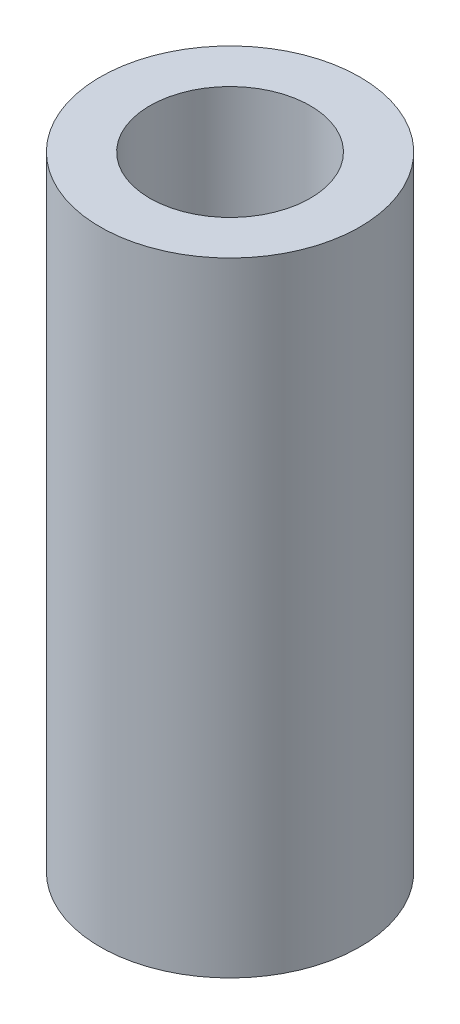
ISO-10303-21;
HEADER;
FILE_DESCRIPTION(('STEP AP214'),'2;1');
FILE_NAME('part.step','',(''),(''),'','','');
FILE_SCHEMA(('AUTOMOTIVE_DESIGN { 1 0 10303 214 1 1 1 1 }'));
ENDSEC;
DATA;
#1=APPLICATION_CONTEXT('core data for automotive mechanical design processes');
#2=APPLICATION_PROTOCOL_DEFINITION('international standard','automotive_design',2000,#1);
#3=PRODUCT_CONTEXT('',#1,'mechanical');
#4=PRODUCT('Part','Part','',(#3));
#5=PRODUCT_RELATED_PRODUCT_CATEGORY('part','',(#4));
#6=PRODUCT_DEFINITION_FORMATION('','',#4);
#7=PRODUCT_DEFINITION_CONTEXT('part definition',#1,'design');
#8=PRODUCT_DEFINITION('design','',#6,#7);
#9=PRODUCT_DEFINITION_SHAPE('','',#8);
#10=(LENGTH_UNIT() NAMED_UNIT(*) SI_UNIT(.MILLI.,.METRE.));
#11=(NAMED_UNIT(*) PLANE_ANGLE_UNIT() SI_UNIT($,.RADIAN.));
#12=(NAMED_UNIT(*) SI_UNIT($,.STERADIAN.) SOLID_ANGLE_UNIT());
#13=UNCERTAINTY_MEASURE_WITH_UNIT(LENGTH_MEASURE(1.E-05),#10,'distance_accuracy_value','');
#14=(GEOMETRIC_REPRESENTATION_CONTEXT(3) GLOBAL_UNCERTAINTY_ASSIGNED_CONTEXT((#13)) GLOBAL_UNIT_ASSIGNED_CONTEXT((#10,
#11,#12)) REPRESENTATION_CONTEXT('',''));
#15=CARTESIAN_POINT('',(0.,0.,0.));
#16=DIRECTION('',(0.,0.,1.));
#17=DIRECTION('',(1.,0.,0.));
#18=AXIS2_PLACEMENT_3D('',#15,#16,#17);
#19=CARTESIAN_POINT('',(0.,38.1,0.));
#20=DIRECTION('',(0.,-1.,0.));
#21=DIRECTION('',(0.,0.,-1.));
#22=AXIS2_PLACEMENT_3D('',#19,#20,#21);
#23=CYLINDRICAL_SURFACE('',#22,7.9375);
#24=CARTESIAN_POINT('',(0.,38.1,0.));
#25=DIRECTION('',(0.,1.,0.));
#26=DIRECTION('',(0.,0.,1.));
#27=AXIS2_PLACEMENT_3D('',#24,#25,#26);
#28=CIRCLE('',#27,7.9375);
#29=CARTESIAN_POINT('',(0.,38.1,-7.9375));
#30=VERTEX_POINT('',#29);
#31=EDGE_CURVE('E10',#30,#30,#28,.T.);
#32=CARTESIAN_POINT('',(0.,0.,0.));
#33=DIRECTION('',(0.,1.,0.));
#34=DIRECTION('',(0.,0.,1.));
#35=AXIS2_PLACEMENT_3D('',#32,#33,#34);
#36=CIRCLE('',#35,7.9375);
#37=CARTESIAN_POINT('',(0.,0.,-7.9375));
#38=VERTEX_POINT('',#37);
#39=EDGE_CURVE('E40',#38,#38,#36,.T.);
#40=CARTESIAN_POINT('',(0.,38.1,-7.9375));
#41=CARTESIAN_POINT('',(0.,37.703125,-7.9375));
#42=CARTESIAN_POINT('',(0.,37.30625,-7.9375));
#43=CARTESIAN_POINT('',(0.,36.5125,-7.9375));
#44=CARTESIAN_POINT('',(0.,36.115625,-7.9375));
#45=CARTESIAN_POINT('',(0.,35.321875,-7.9375));
#46=CARTESIAN_POINT('',(0.,34.925,-7.9375));
#47=CARTESIAN_POINT('',(0.,34.13125,-7.9375));
#48=CARTESIAN_POINT('',(0.,33.734375,-7.9375));
#49=CARTESIAN_POINT('',(0.,32.940625,-7.9375));
#50=CARTESIAN_POINT('',(0.,32.54375,-7.9375));
#51=CARTESIAN_POINT('',(0.,31.75,-7.9375));
#52=CARTESIAN_POINT('',(0.,31.353125,-7.9375));
#53=CARTESIAN_POINT('',(0.,30.559375,-7.9375));
#54=CARTESIAN_POINT('',(0.,30.1625,-7.9375));
#55=CARTESIAN_POINT('',(0.,29.36875,-7.9375));
#56=CARTESIAN_POINT('',(0.,28.971875,-7.9375));
#57=CARTESIAN_POINT('',(0.,28.178125,-7.9375));
#58=CARTESIAN_POINT('',(0.,27.78125,-7.9375));
#59=CARTESIAN_POINT('',(0.,26.9875,-7.9375));
#60=CARTESIAN_POINT('',(0.,26.590625,-7.9375));
#61=CARTESIAN_POINT('',(0.,25.796875,-7.9375));
#62=CARTESIAN_POINT('',(0.,25.4,-7.9375));
#63=CARTESIAN_POINT('',(0.,24.60625,-7.9375));
#64=CARTESIAN_POINT('',(0.,24.209375,-7.9375));
#65=CARTESIAN_POINT('',(0.,23.415625,-7.9375));
#66=CARTESIAN_POINT('',(0.,23.01875,-7.9375));
#67=CARTESIAN_POINT('',(0.,22.225,-7.9375));
#68=CARTESIAN_POINT('',(0.,21.828125,-7.9375));
#69=CARTESIAN_POINT('',(0.,21.034375,-7.9375));
#70=CARTESIAN_POINT('',(0.,20.6375,-7.9375));
#71=CARTESIAN_POINT('',(0.,19.84375,-7.9375));
#72=CARTESIAN_POINT('',(0.,19.446875,-7.9375));
#73=CARTESIAN_POINT('',(0.,18.653125,-7.9375));
#74=CARTESIAN_POINT('',(0.,18.25625,-7.9375));
#75=CARTESIAN_POINT('',(0.,17.4625,-7.9375));
#76=CARTESIAN_POINT('',(0.,17.065625,-7.9375));
#77=CARTESIAN_POINT('',(0.,16.271875,-7.9375));
#78=CARTESIAN_POINT('',(0.,15.875,-7.9375));
#79=CARTESIAN_POINT('',(0.,15.08125,-7.9375));
#80=CARTESIAN_POINT('',(0.,14.684375,-7.9375));
#81=CARTESIAN_POINT('',(0.,13.890625,-7.9375));
#82=CARTESIAN_POINT('',(0.,13.49375,-7.9375));
#83=CARTESIAN_POINT('',(0.,12.7,-7.9375));
#84=CARTESIAN_POINT('',(0.,12.303125,-7.9375));
#85=CARTESIAN_POINT('',(0.,11.509375,-7.9375));
#86=CARTESIAN_POINT('',(0.,11.1125,-7.9375));
#87=CARTESIAN_POINT('',(0.,10.31875,-7.9375));
#88=CARTESIAN_POINT('',(0.,9.92187499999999,-7.9375));
#89=CARTESIAN_POINT('',(0.,9.128125,-7.9375));
#90=CARTESIAN_POINT('',(0.,8.73124999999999,-7.9375));
#91=CARTESIAN_POINT('',(0.,7.93749999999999,-7.9375));
#92=CARTESIAN_POINT('',(0.,7.54062499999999,-7.9375));
#93=CARTESIAN_POINT('',(0.,6.746875,-7.9375));
#94=CARTESIAN_POINT('',(0.,6.35,-7.9375));
#95=CARTESIAN_POINT('',(0.,5.55625,-7.9375));
#96=CARTESIAN_POINT('',(0.,5.159375,-7.9375));
#97=CARTESIAN_POINT('',(0.,4.365625,-7.9375));
#98=CARTESIAN_POINT('',(0.,3.96875,-7.9375));
#99=CARTESIAN_POINT('',(0.,3.175,-7.9375));
#100=CARTESIAN_POINT('',(0.,2.778125,-7.9375));
#101=CARTESIAN_POINT('',(0.,1.984375,-7.9375));
#102=CARTESIAN_POINT('',(0.,1.5875,-7.9375));
#103=CARTESIAN_POINT('',(0.,0.79375,-7.9375));
#104=CARTESIAN_POINT('',(0.,0.396875,-7.9375));
#105=CARTESIAN_POINT('',(0.,0.,-7.9375));
#106=B_SPLINE_CURVE_WITH_KNOTS('',3,(#40,#41,#42,#43,#44,#45,#46,#47,#48,#49,#50,#51,#52,#53,
#54,#55,#56,#57,#58,#59,#60,#61,#62,#63,#64,#65,#66,#67,#68,#69,#70,#71,#72,#73,#74,#75,#76,#77,
#78,#79,#80,#81,#82,#83,#84,#85,#86,#87,#88,#89,#90,#91,#92,#93,#94,#95,#96,#97,#98,#99,#100,
#101,#102,#103,#104,#105),.UNSPECIFIED.,.F.,.F.,(4,2,2,2,2,2,2,2,2,2,2,2,2,2,2,2,2,2,2,2,2,2,2,
2,2,2,2,2,2,2,2,2,4),(0.,1.190625,2.38125,3.571875,4.7625,5.953125,7.14375,8.334375,
9.52500000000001,10.715625,11.90625,13.096875,14.2875,15.478125,16.66875,17.859375,19.05,
20.240625,21.43125,22.621875,23.8125,25.003125,26.19375,27.384375,28.575,29.765625,30.95625,
32.146875,33.3375,34.528125,35.71875,36.909375,38.1),.UNSPECIFIED.);
#107=EDGE_CURVE('BSEAM34',#30,#38,#106,.T.);
#108=ORIENTED_EDGE('',*,*,#31,.F.);
#109=ORIENTED_EDGE('',*,*,#39,.T.);
#110=ORIENTED_EDGE('',*,*,#107,.T.);
#111=ORIENTED_EDGE('',*,*,#107,.F.);
#112=EDGE_LOOP('',(#108,#110,#109,#111));
#113=FACE_BOUND('',#112,.T.);
#114=ADVANCED_FACE('F34',(#113),#23,.T.);
#115=CARTESIAN_POINT('',(0.,38.1,0.));
#116=DIRECTION('',(0.,1.,0.));
#117=DIRECTION('',(0.,0.,1.));
#118=AXIS2_PLACEMENT_3D('',#115,#116,#117);
#119=PLANE('',#118);
#120=CARTESIAN_POINT('',(0.,38.1,0.));
#121=DIRECTION('',(0.,1.,0.));
#122=DIRECTION('',(0.,0.,1.));
#123=AXIS2_PLACEMENT_3D('',#120,#121,#122);
#124=CIRCLE('',#123,4.9022);
#125=CARTESIAN_POINT('',(0.,38.1,4.9022));
#126=VERTEX_POINT('',#125);
#127=EDGE_CURVE('E48',#126,#126,#124,.T.);
#128=ORIENTED_EDGE('',*,*,#127,.F.);
#129=EDGE_LOOP('',(#128));
#130=FACE_BOUND('',#129,.T.);
#131=ORIENTED_EDGE('',*,*,#31,.T.);
#132=EDGE_LOOP('',(#131));
#133=FACE_BOUND('',#132,.T.);
#134=ADVANCED_FACE('F79',(#130,#133),#119,.T.);
#135=CARTESIAN_POINT('',(0.,0.,0.));
#136=DIRECTION('',(0.,1.,0.));
#137=DIRECTION('',(0.,0.,1.));
#138=AXIS2_PLACEMENT_3D('',#135,#136,#137);
#139=PLANE('',#138);
#140=CARTESIAN_POINT('',(0.,0.,0.));
#141=DIRECTION('',(0.,1.,0.));
#142=DIRECTION('',(0.,0.,1.));
#143=AXIS2_PLACEMENT_3D('',#140,#141,#142);
#144=CIRCLE('',#143,2.2479);
#145=CARTESIAN_POINT('',(0.,0.,2.2479));
#146=VERTEX_POINT('',#145);
#147=EDGE_CURVE('E53',#146,#146,#144,.T.);
#148=ORIENTED_EDGE('',*,*,#147,.T.);
#149=EDGE_LOOP('',(#148));
#150=FACE_BOUND('',#149,.T.);
#151=ORIENTED_EDGE('',*,*,#39,.F.);
#152=EDGE_LOOP('',(#151));
#153=FACE_BOUND('',#152,.T.);
#154=ADVANCED_FACE('F75',(#150,#153),#139,.F.);
#155=CARTESIAN_POINT('',(0.,6.35,0.));
#156=DIRECTION('',(0.,1.,0.));
#157=DIRECTION('',(0.,0.,1.));
#158=AXIS2_PLACEMENT_3D('',#155,#156,#157);
#159=CYLINDRICAL_SURFACE('',#158,4.9022);
#160=CARTESIAN_POINT('',(0.,6.35,0.));
#161=DIRECTION('',(0.,1.,0.));
#162=DIRECTION('',(0.,0.,1.));
#163=AXIS2_PLACEMENT_3D('',#160,#161,#162);
#164=CIRCLE('',#163,4.9022);
#165=CARTESIAN_POINT('',(0.,6.35,4.9022));
#166=VERTEX_POINT('',#165);
#167=EDGE_CURVE('E44',#166,#166,#164,.T.);
#168=ORIENTED_EDGE('',*,*,#167,.F.);
#169=EDGE_LOOP('',(#168));
#170=FACE_BOUND('',#169,.T.);
#171=ORIENTED_EDGE('',*,*,#127,.T.);
#172=EDGE_LOOP('',(#171));
#173=FACE_BOUND('',#172,.T.);
#174=ADVANCED_FACE('F69',(#170,#173),#159,.F.);
#175=CARTESIAN_POINT('',(0.,6.35,0.));
#176=DIRECTION('',(0.,1.,0.));
#177=DIRECTION('',(0.,0.,1.));
#178=AXIS2_PLACEMENT_3D('',#175,#176,#177);
#179=PLANE('',#178);
#180=CARTESIAN_POINT('',(0.,6.35,0.));
#181=DIRECTION('',(0.,1.,0.));
#182=DIRECTION('',(0.,0.,1.));
#183=AXIS2_PLACEMENT_3D('',#180,#181,#182);
#184=CIRCLE('',#183,4.2164);
#185=CARTESIAN_POINT('',(0.,6.35,4.2164));
#186=VERTEX_POINT('',#185);
#187=EDGE_CURVE('E59',#186,#186,#184,.T.);
#188=ORIENTED_EDGE('',*,*,#187,.F.);
#189=EDGE_LOOP('',(#188));
#190=FACE_BOUND('',#189,.T.);
#191=ORIENTED_EDGE('',*,*,#167,.T.);
#192=EDGE_LOOP('',(#191));
#193=FACE_BOUND('',#192,.T.);
#194=ADVANCED_FACE('F65',(#190,#193),#179,.T.);
#195=CARTESIAN_POINT('',(0.,6.35,0.));
#196=DIRECTION('',(0.,1.,0.));
#197=DIRECTION('',(0.,0.,1.));
#198=AXIS2_PLACEMENT_3D('',#195,#196,#197);
#199=CYLINDRICAL_SURFACE('',#198,2.2479);
#200=ORIENTED_EDGE('',*,*,#147,.F.);
#201=EDGE_LOOP('',(#200));
#202=FACE_BOUND('',#201,.T.);
#203=CARTESIAN_POINT('',(0.,4.08549979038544,0.));
#204=DIRECTION('',(0.,1.,0.));
#205=DIRECTION('',(0.,0.,1.));
#206=AXIS2_PLACEMENT_3D('',#203,#204,#205);
#207=CIRCLE('',#206,2.2479);
#208=CARTESIAN_POINT('',(0.,4.08549979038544,2.2479));
#209=VERTEX_POINT('',#208);
#210=EDGE_CURVE('E56',#209,#209,#207,.T.);
#211=ORIENTED_EDGE('',*,*,#210,.T.);
#212=EDGE_LOOP('',(#211));
#213=FACE_BOUND('',#212,.T.);
#214=ADVANCED_FACE('F68',(#202,#213),#199,.F.);
#215=CARTESIAN_POINT('',(0.,6.35,0.));
#216=DIRECTION('',(0.,1.,0.));
#217=DIRECTION('',(0.,0.,1.));
#218=AXIS2_PLACEMENT_3D('',#215,#216,#217);
#219=CONICAL_SURFACE('',#218,4.2164,0.715584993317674);
#220=ORIENTED_EDGE('',*,*,#210,.F.);
#221=EDGE_LOOP('',(#220));
#222=FACE_BOUND('',#221,.T.);
#223=ORIENTED_EDGE('',*,*,#187,.T.);
#224=EDGE_LOOP('',(#223));
#225=FACE_BOUND('',#224,.T.);
#226=ADVANCED_FACE('F63',(#222,#225),#219,.F.);
#227=CLOSED_SHELL('',(#114,#134,#154,#174,#194,#214,#226));
#228=MANIFOLD_SOLID_BREP('B2',#227);
#229=ADVANCED_BREP_SHAPE_REPRESENTATION('',(#18,#228),#14);
#230=SHAPE_DEFINITION_REPRESENTATION(#9,#229);
ENDSEC;
END-ISO-10303-21;
